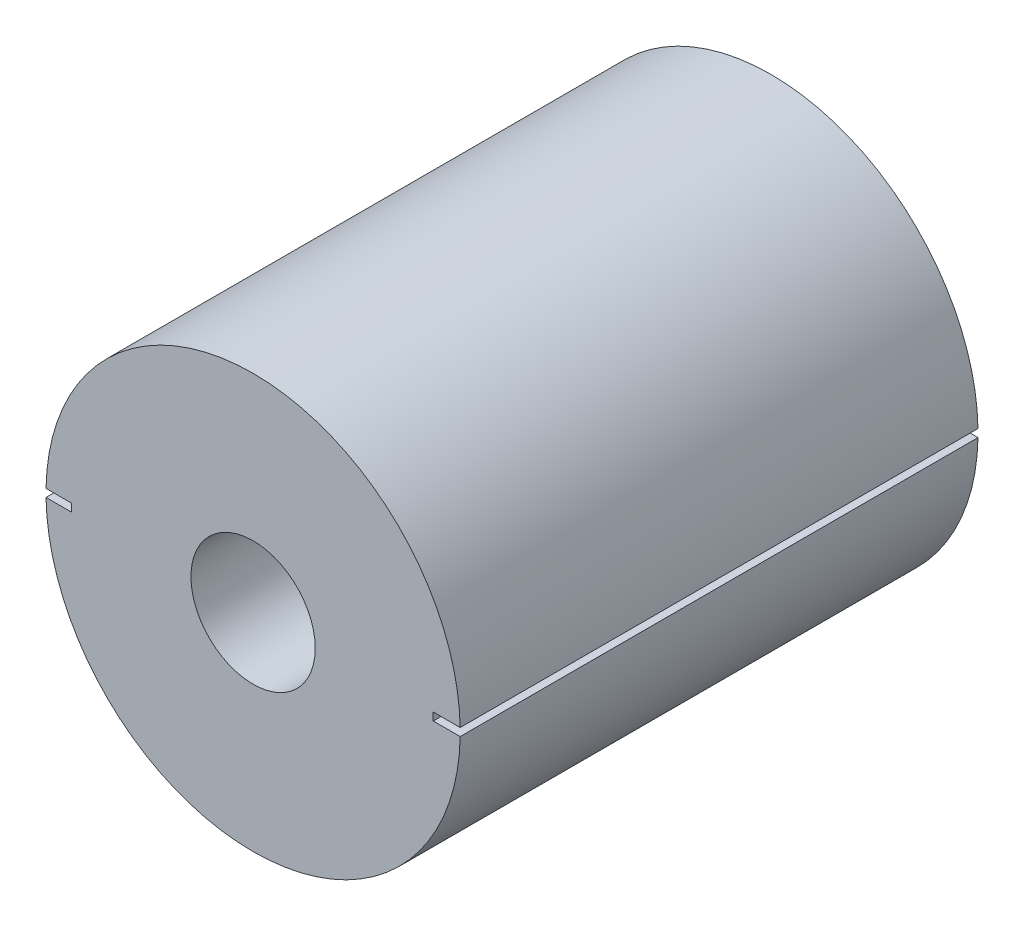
ISO-10303-21;
HEADER;
FILE_DESCRIPTION(('STEP AP214'),'2;1');
FILE_NAME('part.step','',(''),(''),'','','');
FILE_SCHEMA(('AUTOMOTIVE_DESIGN { 1 0 10303 214 1 1 1 1 }'));
ENDSEC;
DATA;
#1=APPLICATION_CONTEXT('core data for automotive mechanical design processes');
#2=APPLICATION_PROTOCOL_DEFINITION('international standard','automotive_design',2000,#1);
#3=PRODUCT_CONTEXT('',#1,'mechanical');
#4=PRODUCT('Part','Part','',(#3));
#5=PRODUCT_RELATED_PRODUCT_CATEGORY('part','',(#4));
#6=PRODUCT_DEFINITION_FORMATION('','',#4);
#7=PRODUCT_DEFINITION_CONTEXT('part definition',#1,'design');
#8=PRODUCT_DEFINITION('design','',#6,#7);
#9=PRODUCT_DEFINITION_SHAPE('','',#8);
#10=(LENGTH_UNIT() NAMED_UNIT(*) SI_UNIT(.MILLI.,.METRE.));
#11=(NAMED_UNIT(*) PLANE_ANGLE_UNIT() SI_UNIT($,.RADIAN.));
#12=(NAMED_UNIT(*) SI_UNIT($,.STERADIAN.) SOLID_ANGLE_UNIT());
#13=UNCERTAINTY_MEASURE_WITH_UNIT(LENGTH_MEASURE(1.E-05),#10,'distance_accuracy_value','');
#14=(GEOMETRIC_REPRESENTATION_CONTEXT(3) GLOBAL_UNCERTAINTY_ASSIGNED_CONTEXT((#13)) GLOBAL_UNIT_ASSIGNED_CONTEXT((#10,
#11,#12)) REPRESENTATION_CONTEXT('',''));
#15=CARTESIAN_POINT('',(0.,0.,0.));
#16=DIRECTION('',(0.,0.,1.));
#17=DIRECTION('',(1.,0.,0.));
#18=AXIS2_PLACEMENT_3D('',#15,#16,#17);
#19=CARTESIAN_POINT('',(0.,0.,25.));
#20=DIRECTION('',(0.,0.,-1.));
#21=DIRECTION('',(-1.,0.,0.));
#22=AXIS2_PLACEMENT_3D('',#19,#20,#21);
#23=CYLINDRICAL_SURFACE('',#22,10.);
#24=CARTESIAN_POINT('',(0.,0.,25.));
#25=DIRECTION('',(0.,0.,1.));
#26=DIRECTION('',(1.,0.,0.));
#27=AXIS2_PLACEMENT_3D('',#24,#25,#26);
#28=CIRCLE('',#27,10.);
#29=CARTESIAN_POINT('',(-9.99821991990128,-0.188675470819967,25.));
#30=VERTEX_POINT('',#29);
#31=CARTESIAN_POINT('',(9.99821991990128,-0.188675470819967,25.));
#32=VERTEX_POINT('',#31);
#33=EDGE_CURVE('E204',#30,#32,#28,.T.);
#34=ORIENTED_EDGE('',*,*,#33,.F.);
#35=DIRECTION('',(0.,0.,-1.));
#36=VECTOR('',#35,1.);
#37=CARTESIAN_POINT('',(-9.99821991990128,-0.188675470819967,25.));
#38=LINE('',#37,#36);
#39=CARTESIAN_POINT('',(-9.99821991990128,-0.188675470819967,0.));
#40=VERTEX_POINT('',#39);
#41=EDGE_CURVE('E181',#30,#40,#38,.T.);
#42=ORIENTED_EDGE('',*,*,#41,.T.);
#43=CARTESIAN_POINT('',(0.,0.,0.));
#44=DIRECTION('',(0.,0.,1.));
#45=DIRECTION('',(1.,0.,0.));
#46=AXIS2_PLACEMENT_3D('',#43,#44,#45);
#47=CIRCLE('',#46,10.);
#48=CARTESIAN_POINT('',(9.99821991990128,-0.188675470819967,0.));
#49=VERTEX_POINT('',#48);
#50=EDGE_CURVE('E201',#40,#49,#47,.T.);
#51=ORIENTED_EDGE('',*,*,#50,.T.);
#52=DIRECTION('',(0.,0.,-1.));
#53=VECTOR('',#52,1.);
#54=CARTESIAN_POINT('',(9.99821991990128,-0.188675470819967,25.));
#55=LINE('',#54,#53);
#56=EDGE_CURVE('E175',#49,#32,#55,.F.);
#57=ORIENTED_EDGE('',*,*,#56,.T.);
#58=EDGE_LOOP('',(#34,#42,#51,#57));
#59=FACE_BOUND('',#58,.T.);
#60=ADVANCED_FACE('F46',(#59),#23,.T.);
#61=CARTESIAN_POINT('',(9.99821991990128,0.188675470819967,0.));
#62=VERTEX_POINT('',#61);
#63=CARTESIAN_POINT('',(-9.99821991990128,0.188675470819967,0.));
#64=VERTEX_POINT('',#63);
#65=EDGE_CURVE('E205',#62,#64,#47,.T.);
#66=ORIENTED_EDGE('',*,*,#65,.T.);
#67=DIRECTION('',(0.,0.,-1.));
#68=VECTOR('',#67,1.);
#69=CARTESIAN_POINT('',(-9.99821991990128,0.188675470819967,25.));
#70=LINE('',#69,#68);
#71=CARTESIAN_POINT('',(-9.99821991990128,0.188675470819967,25.));
#72=VERTEX_POINT('',#71);
#73=EDGE_CURVE('E70',#64,#72,#70,.F.);
#74=ORIENTED_EDGE('',*,*,#73,.T.);
#75=CARTESIAN_POINT('',(9.99821991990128,0.188675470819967,25.));
#76=VERTEX_POINT('',#75);
#77=EDGE_CURVE('E135',#76,#72,#28,.T.);
#78=ORIENTED_EDGE('',*,*,#77,.F.);
#79=DIRECTION('',(0.,0.,-1.));
#80=VECTOR('',#79,1.);
#81=CARTESIAN_POINT('',(9.99821991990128,0.188675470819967,25.));
#82=LINE('',#81,#80);
#83=EDGE_CURVE('E148',#76,#62,#82,.T.);
#84=ORIENTED_EDGE('',*,*,#83,.T.);
#85=EDGE_LOOP('',(#66,#74,#78,#84));
#86=FACE_BOUND('',#85,.T.);
#87=ADVANCED_FACE('F48',(#86),#23,.T.);
#88=CARTESIAN_POINT('',(0.,0.,25.));
#89=DIRECTION('',(0.,0.,1.));
#90=DIRECTION('',(1.,0.,0.));
#91=AXIS2_PLACEMENT_3D('',#88,#89,#90);
#92=PLANE('',#91);
#93=DIRECTION('',(-1.,0.,0.));
#94=VECTOR('',#93,1.);
#95=CARTESIAN_POINT('',(-8.76931721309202,-0.188675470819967,25.));
#96=LINE('',#95,#94);
#97=CARTESIAN_POINT('',(-8.76931721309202,-0.188675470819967,25.));
#98=VERTEX_POINT('',#97);
#99=EDGE_CURVE('E120',#98,#30,#96,.T.);
#100=ORIENTED_EDGE('',*,*,#99,.T.);
#101=ORIENTED_EDGE('',*,*,#33,.T.);
#102=DIRECTION('',(-1.,0.,0.));
#103=VECTOR('',#102,1.);
#104=CARTESIAN_POINT('',(11.3029592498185,-0.188675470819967,25.));
#105=LINE('',#104,#103);
#106=CARTESIAN_POINT('',(8.69704075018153,-0.188675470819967,25.));
#107=VERTEX_POINT('',#106);
#108=EDGE_CURVE('E153',#32,#107,#105,.T.);
#109=ORIENTED_EDGE('',*,*,#108,.T.);
#110=DIRECTION('',(0.,1.,0.));
#111=VECTOR('',#110,1.);
#112=CARTESIAN_POINT('',(8.69704075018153,0.188675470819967,25.));
#113=LINE('',#112,#111);
#114=CARTESIAN_POINT('',(8.69704075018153,0.188675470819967,25.));
#115=VERTEX_POINT('',#114);
#116=EDGE_CURVE('E160',#107,#115,#113,.T.);
#117=ORIENTED_EDGE('',*,*,#116,.T.);
#118=DIRECTION('',(1.,0.,0.));
#119=VECTOR('',#118,1.);
#120=CARTESIAN_POINT('',(11.3029592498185,0.188675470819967,25.));
#121=LINE('',#120,#119);
#122=EDGE_CURVE('E166',#115,#76,#121,.T.);
#123=ORIENTED_EDGE('',*,*,#122,.T.);
#124=ORIENTED_EDGE('',*,*,#77,.T.);
#125=DIRECTION('',(1.,0.,0.));
#126=VECTOR('',#125,1.);
#127=CARTESIAN_POINT('',(-8.76931721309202,0.188675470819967,25.));
#128=LINE('',#127,#126);
#129=CARTESIAN_POINT('',(-8.76931721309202,0.188675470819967,25.));
#130=VERTEX_POINT('',#129);
#131=EDGE_CURVE('E114',#72,#130,#128,.T.);
#132=ORIENTED_EDGE('',*,*,#131,.T.);
#133=DIRECTION('',(0.,-1.,0.));
#134=VECTOR('',#133,1.);
#135=CARTESIAN_POINT('',(-8.76931721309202,0.188675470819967,25.));
#136=LINE('',#135,#134);
#137=EDGE_CURVE('E123',#130,#98,#136,.T.);
#138=ORIENTED_EDGE('',*,*,#137,.T.);
#139=EDGE_LOOP('',(#100,#101,#109,#117,#123,#124,#132,#138));
#140=FACE_BOUND('',#139,.T.);
#141=CARTESIAN_POINT('',(0.,0.,25.));
#142=DIRECTION('',(0.,0.,1.));
#143=DIRECTION('',(1.,0.,0.));
#144=AXIS2_PLACEMENT_3D('',#141,#142,#143);
#145=CIRCLE('',#144,3.);
#146=CARTESIAN_POINT('',(3.,0.,25.));
#147=VERTEX_POINT('',#146);
#148=EDGE_CURVE('E197',#147,#147,#145,.T.);
#149=ORIENTED_EDGE('',*,*,#148,.F.);
#150=EDGE_LOOP('',(#149));
#151=FACE_BOUND('',#150,.T.);
#152=ADVANCED_FACE('F131',(#140,#151),#92,.T.);
#153=CARTESIAN_POINT('',(0.,0.,0.));
#154=DIRECTION('',(0.,0.,1.));
#155=DIRECTION('',(1.,0.,0.));
#156=AXIS2_PLACEMENT_3D('',#153,#154,#155);
#157=PLANE('',#156);
#158=CARTESIAN_POINT('',(0.,0.,0.));
#159=DIRECTION('',(0.,0.,-1.));
#160=DIRECTION('',(-1.,0.,0.));
#161=AXIS2_PLACEMENT_3D('',#158,#159,#160);
#162=CIRCLE('',#161,4.);
#163=CARTESIAN_POINT('',(-4.,0.,0.));
#164=VERTEX_POINT('',#163);
#165=EDGE_CURVE('E185',#164,#164,#162,.T.);
#166=ORIENTED_EDGE('',*,*,#165,.F.);
#167=EDGE_LOOP('',(#166));
#168=FACE_BOUND('',#167,.T.);
#169=ORIENTED_EDGE('',*,*,#50,.F.);
#170=DIRECTION('',(-1.,0.,0.));
#171=VECTOR('',#170,1.);
#172=CARTESIAN_POINT('',(-8.76931721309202,-0.188675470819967,0.));
#173=LINE('',#172,#171);
#174=CARTESIAN_POINT('',(-8.76931721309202,-0.188675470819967,0.));
#175=VERTEX_POINT('',#174);
#176=EDGE_CURVE('E137',#175,#40,#173,.T.);
#177=ORIENTED_EDGE('',*,*,#176,.F.);
#178=DIRECTION('',(0.,-1.,0.));
#179=VECTOR('',#178,1.);
#180=CARTESIAN_POINT('',(-8.76931721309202,0.188675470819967,0.));
#181=LINE('',#180,#179);
#182=CARTESIAN_POINT('',(-8.76931721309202,0.188675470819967,0.));
#183=VERTEX_POINT('',#182);
#184=EDGE_CURVE('E140',#183,#175,#181,.T.);
#185=ORIENTED_EDGE('',*,*,#184,.F.);
#186=DIRECTION('',(-1.,0.,0.));
#187=VECTOR('',#186,1.);
#188=CARTESIAN_POINT('',(0.,0.188675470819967,0.));
#189=LINE('',#188,#187);
#190=EDGE_CURVE('E12',#183,#64,#189,.T.);
#191=ORIENTED_EDGE('',*,*,#190,.T.);
#192=ORIENTED_EDGE('',*,*,#65,.F.);
#193=DIRECTION('',(1.,0.,0.));
#194=VECTOR('',#193,1.);
#195=CARTESIAN_POINT('',(11.3029592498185,0.188675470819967,0.));
#196=LINE('',#195,#194);
#197=CARTESIAN_POINT('',(8.69704075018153,0.188675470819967,0.));
#198=VERTEX_POINT('',#197);
#199=EDGE_CURVE('E157',#198,#62,#196,.T.);
#200=ORIENTED_EDGE('',*,*,#199,.F.);
#201=DIRECTION('',(0.,1.,0.));
#202=VECTOR('',#201,1.);
#203=CARTESIAN_POINT('',(8.69704075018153,0.188675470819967,0.));
#204=LINE('',#203,#202);
#205=CARTESIAN_POINT('',(8.69704075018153,-0.188675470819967,0.));
#206=VERTEX_POINT('',#205);
#207=EDGE_CURVE('E62',#206,#198,#204,.T.);
#208=ORIENTED_EDGE('',*,*,#207,.F.);
#209=DIRECTION('',(1.,0.,0.));
#210=VECTOR('',#209,1.);
#211=CARTESIAN_POINT('',(0.,-0.188675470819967,0.));
#212=LINE('',#211,#210);
#213=EDGE_CURVE('E55',#206,#49,#212,.T.);
#214=ORIENTED_EDGE('',*,*,#213,.T.);
#215=EDGE_LOOP('',(#169,#177,#185,#191,#192,#200,#208,#214));
#216=FACE_BOUND('',#215,.T.);
#217=ADVANCED_FACE('F213',(#168,#216),#157,.F.);
#218=CARTESIAN_POINT('',(0.,0.,12.5));
#219=DIRECTION('',(0.,0.,1.));
#220=DIRECTION('',(1.,0.,0.));
#221=AXIS2_PLACEMENT_3D('',#218,#219,#220);
#222=CYLINDRICAL_SURFACE('',#221,3.);
#223=CARTESIAN_POINT('',(0.,0.,12.5));
#224=DIRECTION('',(0.,0.,1.));
#225=DIRECTION('',(1.,0.,0.));
#226=AXIS2_PLACEMENT_3D('',#223,#224,#225);
#227=CIRCLE('',#226,3.);
#228=CARTESIAN_POINT('',(3.,0.,12.5));
#229=VERTEX_POINT('',#228);
#230=EDGE_CURVE('E190',#229,#229,#227,.T.);
#231=ORIENTED_EDGE('',*,*,#230,.F.);
#232=EDGE_LOOP('',(#231));
#233=FACE_BOUND('',#232,.T.);
#234=ORIENTED_EDGE('',*,*,#148,.T.);
#235=EDGE_LOOP('',(#234));
#236=FACE_BOUND('',#235,.T.);
#237=ADVANCED_FACE('F255',(#233,#236),#222,.F.);
#238=CARTESIAN_POINT('',(0.,0.,12.5));
#239=DIRECTION('',(0.,0.,-1.));
#240=DIRECTION('',(-1.,0.,0.));
#241=AXIS2_PLACEMENT_3D('',#238,#239,#240);
#242=PLANE('',#241);
#243=CARTESIAN_POINT('',(0.,0.,12.5));
#244=DIRECTION('',(0.,0.,-1.));
#245=DIRECTION('',(-1.,0.,0.));
#246=AXIS2_PLACEMENT_3D('',#243,#244,#245);
#247=CIRCLE('',#246,4.);
#248=CARTESIAN_POINT('',(-4.,0.,12.5));
#249=VERTEX_POINT('',#248);
#250=EDGE_CURVE('E186',#249,#249,#247,.T.);
#251=ORIENTED_EDGE('',*,*,#250,.T.);
#252=EDGE_LOOP('',(#251));
#253=FACE_BOUND('',#252,.T.);
#254=ORIENTED_EDGE('',*,*,#230,.T.);
#255=EDGE_LOOP('',(#254));
#256=FACE_BOUND('',#255,.T.);
#257=ADVANCED_FACE('F240',(#253,#256),#242,.T.);
#258=CARTESIAN_POINT('',(0.,0.,12.5));
#259=DIRECTION('',(0.,0.,-1.));
#260=DIRECTION('',(-1.,0.,0.));
#261=AXIS2_PLACEMENT_3D('',#258,#259,#260);
#262=CYLINDRICAL_SURFACE('',#261,4.);
#263=ORIENTED_EDGE('',*,*,#250,.F.);
#264=EDGE_LOOP('',(#263));
#265=FACE_BOUND('',#264,.T.);
#266=ORIENTED_EDGE('',*,*,#165,.T.);
#267=EDGE_LOOP('',(#266));
#268=FACE_BOUND('',#267,.T.);
#269=ADVANCED_FACE('F233',(#265,#268),#262,.F.);
#270=CARTESIAN_POINT('',(11.3029592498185,-0.188675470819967,25.));
#271=DIRECTION('',(0.,-1.,0.));
#272=DIRECTION('',(0.,0.,-1.));
#273=AXIS2_PLACEMENT_3D('',#270,#271,#272);
#274=PLANE('',#273);
#275=ORIENTED_EDGE('',*,*,#213,.F.);
#276=DIRECTION('',(0.,0.,-1.));
#277=VECTOR('',#276,1.);
#278=CARTESIAN_POINT('',(8.69704075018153,-0.188675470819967,25.));
#279=LINE('',#278,#277);
#280=EDGE_CURVE('E154',#107,#206,#279,.T.);
#281=ORIENTED_EDGE('',*,*,#280,.F.);
#282=ORIENTED_EDGE('',*,*,#108,.F.);
#283=ORIENTED_EDGE('',*,*,#56,.F.);
#284=EDGE_LOOP('',(#275,#281,#282,#283));
#285=FACE_BOUND('',#284,.T.);
#286=ADVANCED_FACE('F231',(#285),#274,.F.);
#287=CARTESIAN_POINT('',(11.3029592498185,0.188675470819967,25.));
#288=DIRECTION('',(0.,1.,0.));
#289=DIRECTION('',(0.,0.,1.));
#290=AXIS2_PLACEMENT_3D('',#287,#288,#289);
#291=PLANE('',#290);
#292=ORIENTED_EDGE('',*,*,#122,.F.);
#293=DIRECTION('',(0.,0.,-1.));
#294=VECTOR('',#293,1.);
#295=CARTESIAN_POINT('',(8.69704075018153,0.188675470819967,25.));
#296=LINE('',#295,#294);
#297=EDGE_CURVE('E150',#115,#198,#296,.T.);
#298=ORIENTED_EDGE('',*,*,#297,.T.);
#299=ORIENTED_EDGE('',*,*,#199,.T.);
#300=ORIENTED_EDGE('',*,*,#83,.F.);
#301=EDGE_LOOP('',(#292,#298,#299,#300));
#302=FACE_BOUND('',#301,.T.);
#303=ADVANCED_FACE('F228',(#302),#291,.F.);
#304=CARTESIAN_POINT('',(8.69704075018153,0.188675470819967,25.));
#305=DIRECTION('',(-1.,0.,0.));
#306=DIRECTION('',(0.,0.,1.));
#307=AXIS2_PLACEMENT_3D('',#304,#305,#306);
#308=PLANE('',#307);
#309=ORIENTED_EDGE('',*,*,#207,.T.);
#310=ORIENTED_EDGE('',*,*,#297,.F.);
#311=ORIENTED_EDGE('',*,*,#116,.F.);
#312=ORIENTED_EDGE('',*,*,#280,.T.);
#313=EDGE_LOOP('',(#309,#310,#311,#312));
#314=FACE_BOUND('',#313,.T.);
#315=ADVANCED_FACE('F230',(#314),#308,.F.);
#316=CARTESIAN_POINT('',(-8.76931721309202,-0.188675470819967,25.));
#317=DIRECTION('',(0.,-1.,0.));
#318=DIRECTION('',(0.,0.,-1.));
#319=AXIS2_PLACEMENT_3D('',#316,#317,#318);
#320=PLANE('',#319);
#321=ORIENTED_EDGE('',*,*,#99,.F.);
#322=DIRECTION('',(0.,0.,-1.));
#323=VECTOR('',#322,1.);
#324=CARTESIAN_POINT('',(-8.76931721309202,-0.188675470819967,25.));
#325=LINE('',#324,#323);
#326=EDGE_CURVE('E119',#98,#175,#325,.T.);
#327=ORIENTED_EDGE('',*,*,#326,.T.);
#328=ORIENTED_EDGE('',*,*,#176,.T.);
#329=ORIENTED_EDGE('',*,*,#41,.F.);
#330=EDGE_LOOP('',(#321,#327,#328,#329));
#331=FACE_BOUND('',#330,.T.);
#332=ADVANCED_FACE('F223',(#331),#320,.F.);
#333=CARTESIAN_POINT('',(-8.76931721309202,0.188675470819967,25.));
#334=DIRECTION('',(0.,1.,0.));
#335=DIRECTION('',(0.,0.,1.));
#336=AXIS2_PLACEMENT_3D('',#333,#334,#335);
#337=PLANE('',#336);
#338=ORIENTED_EDGE('',*,*,#190,.F.);
#339=DIRECTION('',(0.,0.,-1.));
#340=VECTOR('',#339,1.);
#341=CARTESIAN_POINT('',(-8.76931721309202,0.188675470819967,25.));
#342=LINE('',#341,#340);
#343=EDGE_CURVE('E110',#130,#183,#342,.T.);
#344=ORIENTED_EDGE('',*,*,#343,.F.);
#345=ORIENTED_EDGE('',*,*,#131,.F.);
#346=ORIENTED_EDGE('',*,*,#73,.F.);
#347=EDGE_LOOP('',(#338,#344,#345,#346));
#348=FACE_BOUND('',#347,.T.);
#349=ADVANCED_FACE('F112',(#348),#337,.F.);
#350=CARTESIAN_POINT('',(-8.76931721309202,0.188675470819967,25.));
#351=DIRECTION('',(1.,0.,0.));
#352=DIRECTION('',(0.,0.,-1.));
#353=AXIS2_PLACEMENT_3D('',#350,#351,#352);
#354=PLANE('',#353);
#355=ORIENTED_EDGE('',*,*,#184,.T.);
#356=ORIENTED_EDGE('',*,*,#326,.F.);
#357=ORIENTED_EDGE('',*,*,#137,.F.);
#358=ORIENTED_EDGE('',*,*,#343,.T.);
#359=EDGE_LOOP('',(#355,#356,#357,#358));
#360=FACE_BOUND('',#359,.T.);
#361=ADVANCED_FACE('F124',(#360),#354,.F.);
#362=CLOSED_SHELL('',(#60,#87,#152,#217,#237,#257,#269,#286,#303,#315,#332,#349,#361));
#363=MANIFOLD_SOLID_BREP('B2',#362);
#364=ADVANCED_BREP_SHAPE_REPRESENTATION('',(#18,#363),#14);
#365=SHAPE_DEFINITION_REPRESENTATION(#9,#364);
ENDSEC;
END-ISO-10303-21;
